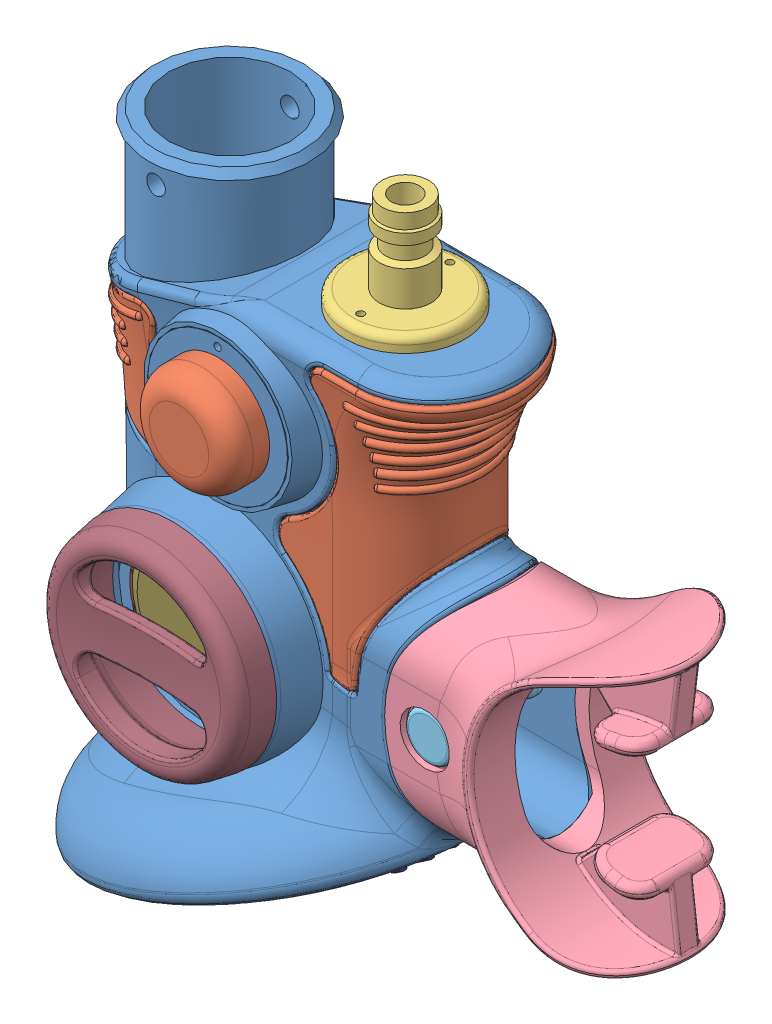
SolidWorks assembly AIRSOURCE.SLDASM, configuration Default (file format 3100). Lengths in mm.
Overall size (103.27 114.79 75.74).
35 component instances, 29 part files, 27 mates.
Components (placement in the parent):
- RegulatorBody-1: RegulatorBody.SLDASM [Default] at origin size (73.37 104.55 63.08)
  - RegulatorBody-1: RegulatorBody.SLDPRT [Default] at origin size (73.37 104.55 63.08)
  - Overmold-1: Overmold.SLDPRT [Full] at origin size (70.51 47.83 36.83)
- QDPlug-1: QDPlug.SLDPRT [Default] at (14.7942 0 0) size (20.32 24.13 20.32)
- LowPressureValve-1: LowPressureValve.SLDASM [Default] at (14.7942 -7.62 0) x (0 0 -1) z (1 0 0) size (16.51 58.42 16.51)
  - LowPressureValveBody-1: LowPressureValveBody.sldprt [Default] at origin size (16.51 58.42 16.51)
  - AirFilter-2: AirFilter.SLDPRT [Default] at origin size (10.16 8.64 10.16)
  - LPValveO-Ring1-1: LPValveO-Ring1.SLDPRT [Default] at (0 -4.445 0) size (13.72 2.03 13.72)
  - LPValveO-Ring2-1: LPValveO-Ring2.SLDPRT [Default] at (0 -11.557 0) size (16.41 2.54 16.41)
  - LPValveO-Ring3-1: LPValveO-Ring3.SLDPRT [Default] at (0 -22.225 0) size (16.41 2.54 16.41)
- ManualInflator-1: ManualInflator.SLDASM [Default] at (-5.6896 -50.4698 -9.9039) x (0 1 0) z (-1 0 0) size (27.94 27.43 27.94)
  - OralButtonBezel-1: OralButtonBezel.SLDPRT [Default] at origin size (23.88 7.11 23.88)
  - OralButtonCover-1: OralButtonCover.SLDPRT [Default] at (0 -10.7603 0) size (24.89 13.21 24.89)
  - OralPushRod-1: OralPushRod.SLDPRT [Default] at (0 8.128 0) size (22.84 22.35 22.84)
  - OralSeal-1: OralSeal.SLDPRT [Default] at (0 -11.684 0) size (27.94 3.81 27.94)
  - ManualInflatorSpring-1: ManualInflatorSpring.SLDPRT [Default] at (0 -2.794 0) size (15.24 11.43 15.24)
  - PanScrew1-4-1: PanScrew1-4.SLDPRT [Default] at (0 -12.954 0) x (0.999414 0 -0.034226) z (-0.034226 0 -0.999414) size (6.35 14.89 6.35)
- ExhaustValveRetainer-1: ExhaustValveRetainer.SLDPRT [Default] at (-5.6896 -50.4698 13.97) x (0.998902 0.046844 0) z (-0.046844 0.998902 0) size (25.4 3.81 25.4)
- ExhasutValve-1: ExhasutValve.SLDPRT [Default] at (-5.6896 -50.4698 14.6287) x (-0.995632 0.093363 0) z (-0.093363 -0.995632 0) size (27.28 3.63 27.28)
- ExhaustCap-1: ExhaustCap.SLDPRT [Default] at (-5.6896 -50.4698 19.304) x (1 0 0) z (0 -1 0) size (35.56 10.52 35.56)
- Diaphram-1: Diaphram.SLDASM [Default] at (-1.1545 -79.6912 0) x (-0.951057 -0.309017 0) z (0 0 1) size (75.74 14.1 75.74)
  - DiaphramRetainer-1: DiaphramRetainer.SLDPRT [Default] at origin size (57.15 4.45 57.15)
  - DiaphramRing-1: DiaphramRing.SLDPRT [Default] at (0 -4.445 0) x (1 0 0) z (0 -1 0) size (54.36 54.36 0.76)
  - Diaphram-1: Diaphram.SLDPRT [Default] at (0 -5.207 0) x (0 1 0) z (0.536779 0 0.843723) size (11.06 54.86 54.86)
  - DiaphramCover-1: DiaphramCover.SLDPRT [Default] at (0 6.985 0) x (1 0 0) z (0 1 0) size (56.9 56.9 11.18)
- PowerInflator-1: PowerInflator.SLDASM [Default] at (0 -15.3416 10.3378) x (-1 0 0) z (0 1 0) size (23.88 22.56 23.88)
  - ValveRetainer-1: ValveRetainer.SLDPRT [Default] at origin size (19.05 15.82 19.05)
  - PowerButtonBezel-1: PowerButtonBezel.SLDPRT [Default] at (0 6.985 0) size (23.88 6.68 23.88)
  - PowerButtonCover-1: PowerButtonCover.SLDPRT [Default] at (0 3.429 0) size (19.3 10.16 19.3)
  - PowerButton-1: PowerButton.SLDPRT [Default] at (0 9.525 0) size (16.02 6.86 16.02)
  - PowerInflatorO-Ring-1: PowerInflatorO-Ring.SLDPRT [Default] at (-1.4986 -2.54 0) x (1 0 0) z (0 0 -1) size (9.98 1.78 9.98)
  - PowerInflatorSpring-1: PowerInflatorSpring.SLDPRT [Default] at (0 9.017 0) x (1 0 0) z (0 0 -1) size (8.38 7.74 8.38)
- MouthPiece-1: MouthPiece.SLDPRT [Default] at (60.8584 -50.4698 0) x (0 -1 0) z (0 0 1) size (44.9 40.54 30.56)
- MouthPiecePin-1: MouthPiecePin.SLDPRT [Default] at (30.4292 -50.4698 11.049) x (0.784706 -0.619869 0) z (-0.619869 -0.784706 0) size (8.13 8.94 8.13)
- MouthPiecePin-2: MouthPiecePin.SLDPRT [Default] at (30.4292 -50.4698 -11.049) x (1 0 0) z (0 1 0) size (8.13 8.94 8.13)
Mates (geometry in assembly coordinates):
- MateCoincident1: coincident aligned: plane of RegulatorBody-1; plane of assembly
- MateCoincident2: coincident aligned: plane of RegulatorBody-1; plane of assembly
- MateCoincident3: coincident aligned: plane of RegulatorBody-1; plane of assembly
- MateCoincident4: coincident: plane of QDPlug-1; plane of LowPressureValve-1/LowPressureValveBody-1
- MateParallel1: parallel anti-aligned: plane of ?; plane of assembly
- MateCoincident5: coincident: plane of ?; plane of ManualInflator-1/OralButtonCover-1
- MateConcentric1: concentric anti-aligned: cylinder of ?; cylinder of ManualInflator-1/OralButtonCover-1
- MateConcentric2: concentric aligned: cylinder of ?; cylinder of LowPressureValve-1/LowPressureValveBody-1
- MateConcentric3: concentric anti-aligned: cylinder of ?; cylinder of QDPlug-1
- MateConcentric4: concentric: cylinder of ?; cylinder of ExhaustValveRetainer-1
- MateCoincident7: coincident aligned: plane of ?; plane of ExhaustValveRetainer-1
- MateConcentric5: concentric aligned: cylinder of ExhaustValveRetainer-1; cylinder of ExhasutValve-1
- MateDistance1: distance = 0.127 mm: plane of ExhaustValveRetainer-1; plane of ExhasutValve-1
- MateCoincident8: coincident aligned: line of ?; line of ExhaustCap-1
- MateCoincident10: coincident: plane of ?; plane of ExhaustCap-1
- MateCoincident11: coincident aligned: plane of ?; plane of Diaphram-1/DiaphramRetainer-1
- MateParallel2: parallel aligned: plane of ?; plane of assembly
- MateConcentric6: concentric anti-aligned: cylinder of ?; cylinder of PowerInflator-1/ValveRetainer-1
- MateParallel3: parallel anti-aligned: plane of ?; plane of assembly
- MateCoincident12: coincident anti-aligned: plane of ?; plane of PowerInflator-1/ValveRetainer-1
- MateCoincident13: coincident aligned: plane of MouthPiece-1; plane of assembly
- MateCoincident14: coincident: plane of ?; plane of MouthPiece-1
- MateConcentric7: concentric aligned: cylinder of ?; cylinder of MouthPiece-1
- MateCoincident15: coincident anti-aligned: plane of MouthPiece-1; plane of MouthPiecePin-1
- MateConcentric8: concentric aligned: cylinder of MouthPiece-1; cylinder of MouthPiecePin-1
- MateCoincident16: coincident anti-aligned: plane of MouthPiece-1; plane of MouthPiecePin-2
- MateConcentric9: concentric anti-aligned: 
